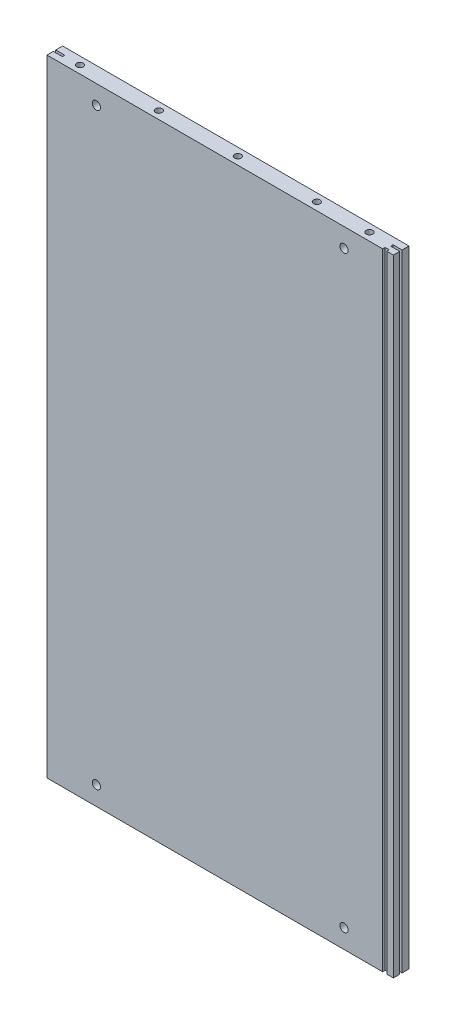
from build123d import *

# Parameters (mm, degrees)
SKIZZE1_W                               = 421
SKIZZE1_H                               = 761
AUFSATZ_LINEAR_AUSTRAGEN1_DEPTH         = 19
SKIZZE3_W                               = 5
SKIZZE3_H                               = 3
SCHNITT_LINEAR_AUSTRAGEN1_DEPTH         = 790.805197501
F_8_0_8_DURCHMESSER_BOHRUNG2_AT_2_COUNT = 2
F_8_0_8_DURCHMESSER_BOHRUNG2_AT_2_PITCH = 64
F_8_0_8_DURCHMESSER_BOHRUNG2_AT_3_COUNT = 2
F_8_0_8_DURCHMESSER_BOHRUNG2_AT_3_PITCH = 160
F_8_0_8_DURCHMESSER_BOHRUNG2_AT_4_COUNT = 2
F_8_0_8_DURCHMESSER_BOHRUNG2_AT_4_PITCH = 256
F_8_0_8_DURCHMESSER_BOHRUNG2_AT_5_COUNT = 2
F_8_0_8_DURCHMESSER_BOHRUNG2_AT_5_PITCH = 352
F_10_0_10_DURCHMESSER_BOHRUNG1_D        = 10
SKIZZE11_W                              = 11
SKIZZE11_H                              = 2.9
SCHNITT_LINEAR_AUSTRAGEN2_DEPTH         = 790.805197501


with BuildPart() as part:
    # Skizze1 → Aufsatz-Linear austragen1 (new body)
    with BuildSketch(Plane.XY):
        Rectangle(SKIZZE1_W, SKIZZE1_H)
    extrude(amount=AUFSATZ_LINEAR_AUSTRAGEN1_DEPTH)

    # Skizze3 → Schnitt-Linear austragen1 (cut, through all)
    with BuildSketch(Plane.XZ.offset(380.5)):
        with Locations((200, 17.5)):
            Rectangle(SKIZZE3_W, SKIZZE3_H)
    extrude(amount=-SCHNITT_LINEAR_AUSTRAGEN1_DEPTH, mode=Mode.SUBTRACT)

    # Skizze7 → 8.0 _8_ Durchmesser Bohrung2 (revolve, cut)
    with BuildSketch(Plane(origin=(172, -380.5, 9.5), x_dir=(0, 0, -1), z_dir=(1, 0, 0))):
        Polygon((0, 0), (0, 29.403442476), (4, 27), (4, 0), align=None)
    f_8_0_8_durchmesser_bohrung2 = revolve(axis=Axis((172, -386.85, 9.5), (0, 1, 0)), mode=Mode.SUBTRACT)

    # 8.0 _8_ Durchmesser Bohrung2 at 2: 8.0 _8_ Durchmesser Bohrung2 ×2
    with Locations(*[(-i * F_8_0_8_DURCHMESSER_BOHRUNG2_AT_2_PITCH, 0, 0) for i in range(1, F_8_0_8_DURCHMESSER_BOHRUNG2_AT_2_COUNT)]):
        add(f_8_0_8_durchmesser_bohrung2, mode=Mode.SUBTRACT)

    # 8.0 _8_ Durchmesser Bohrung2 at 3: 8.0 _8_ Durchmesser Bohrung2 ×2
    with Locations(*[(-i * F_8_0_8_DURCHMESSER_BOHRUNG2_AT_3_PITCH, 0, 0) for i in range(1, F_8_0_8_DURCHMESSER_BOHRUNG2_AT_3_COUNT)]):
        add(f_8_0_8_durchmesser_bohrung2, mode=Mode.SUBTRACT)

    # 8.0 _8_ Durchmesser Bohrung2 at 4: 8.0 _8_ Durchmesser Bohrung2 ×2
    with Locations(*[(-i * F_8_0_8_DURCHMESSER_BOHRUNG2_AT_4_PITCH, 0, 0) for i in range(1, F_8_0_8_DURCHMESSER_BOHRUNG2_AT_4_COUNT)]):
        add(f_8_0_8_durchmesser_bohrung2, mode=Mode.SUBTRACT)

    # 8.0 _8_ Durchmesser Bohrung2 at 5: 8.0 _8_ Durchmesser Bohrung2 ×2
    with Locations(*[(-i * F_8_0_8_DURCHMESSER_BOHRUNG2_AT_5_PITCH, 0, 0) for i in range(1, F_8_0_8_DURCHMESSER_BOHRUNG2_AT_5_COUNT)]):
        add(f_8_0_8_durchmesser_bohrung2, mode=Mode.SUBTRACT)

    # Spiegeln1: 8.0 _8_ Durchmesser Bohrung2 across plane
    add(f_8_0_8_durchmesser_bohrung2.mirror(Plane.ZX), mode=Mode.SUBTRACT)

    # Spiegeln1 copy 1 sketch → Spiegeln1 copy 1 (revolve, cut)
    with BuildSketch(Plane(origin=(108, 380.5, 9.5), x_dir=(0, 0, -1), z_dir=(1, 0, 0))):
        Polygon((0, 0), (0, -29.403442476), (4, -27), (4, 0), align=None)
    revolve(axis=Axis((108, 386.85, 9.5), (0, 1, 0)), mode=Mode.SUBTRACT)

    # Spiegeln1 copy 2 sketch → Spiegeln1 copy 2 (revolve, cut)
    with BuildSketch(Plane(origin=(12, 380.5, 9.5), x_dir=(0, 0, -1), z_dir=(1, 0, 0))):
        Polygon((0, 0), (0, -29.403442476), (4, -27), (4, 0), align=None)
    revolve(axis=Axis((12, 386.85, 9.5), (0, 1, 0)), mode=Mode.SUBTRACT)

    # Spiegeln1 copy 3 sketch → Spiegeln1 copy 3 (revolve, cut)
    with BuildSketch(Plane(origin=(-84, 380.5, 9.5), x_dir=(0, 0, -1), z_dir=(1, 0, 0))):
        Polygon((0, 0), (0, -29.403442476), (4, -27), (4, 0), align=None)
    revolve(axis=Axis((-84, 386.85, 9.5), (0, 1, 0)), mode=Mode.SUBTRACT)

    # Spiegeln1 copy 4 sketch → Spiegeln1 copy 4 (revolve, cut)
    with BuildSketch(Plane(origin=(-180, 380.5, 9.5), x_dir=(0, 0, -1), z_dir=(1, 0, 0))):
        Polygon((0, 0), (0, -29.403442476), (4, -27), (4, 0), align=None)
    revolve(axis=Axis((-180, 386.85, 9.5), (0, 1, 0)), mode=Mode.SUBTRACT)

    # 10.0 _10_ Durchmesser Bohrung1 (through all)
    with Locations(Plane.XY.offset(19)):
        with Locations((-150.5, 357.5), (150.5, 357.5), (150.5, -357.5), (-150.5, -357.5)):
            Hole(F_10_0_10_DURCHMESSER_BOHRUNG1_D / 2)

    # Skizze11 → Schnitt-Linear austragen2 (cut, through all)
    with BuildSketch(Plane(origin=(0, 380.5, 0), x_dir=(1, 0, 0), z_dir=(0, 1, 0))):
        with Locations((205, -9.85)):
            Rectangle(SKIZZE11_W, SKIZZE11_H)
        with Locations((-205, -9.85)):
            Rectangle(SKIZZE11_W, SKIZZE11_H)
    extrude(amount=-SCHNITT_LINEAR_AUSTRAGEN2_DEPTH, mode=Mode.SUBTRACT)


solid = part.part
